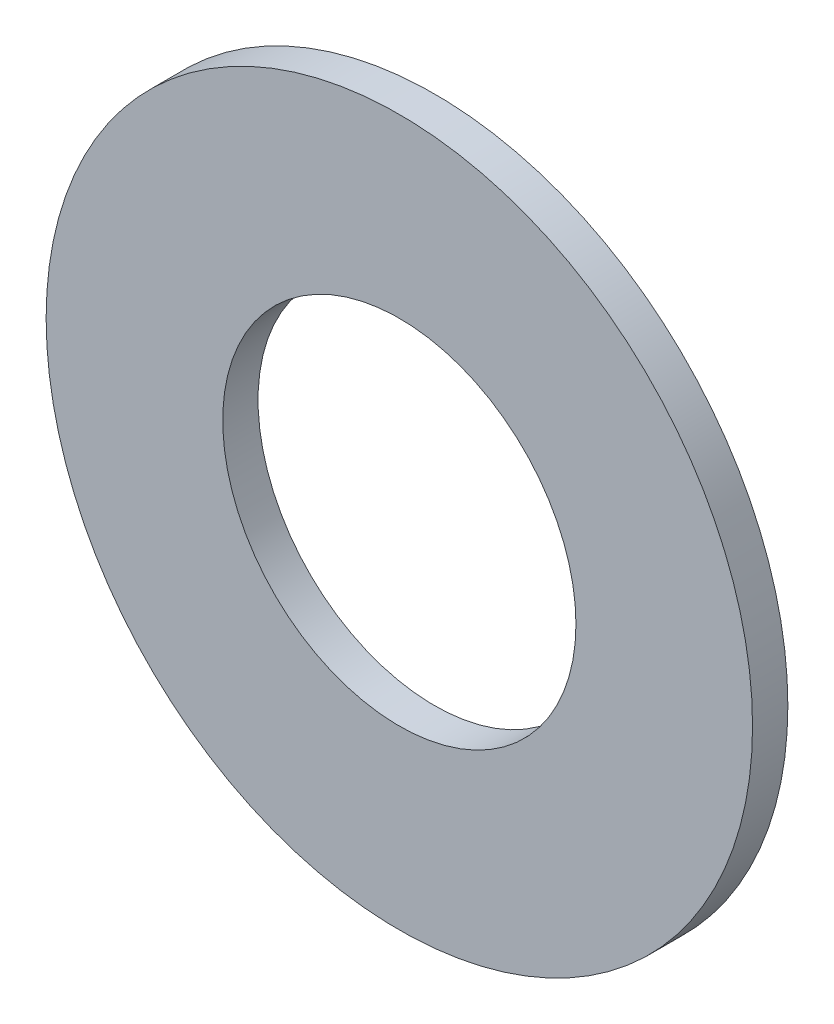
from build123d import *

# Parameters (mm, degrees)
ESQUISSE1_R          = 10
ESQUISSE1_R_2        = 5
BASE_EXTRUSION_DEPTH = 1


with BuildPart() as part:
    # Esquisse1 → Base-Extrusion (new body)
    with BuildSketch(Plane.XY):
        Circle(ESQUISSE1_R)
        Circle(ESQUISSE1_R_2, mode=Mode.SUBTRACT)
    extrude(amount=-BASE_EXTRUSION_DEPTH)


solid = part.part
